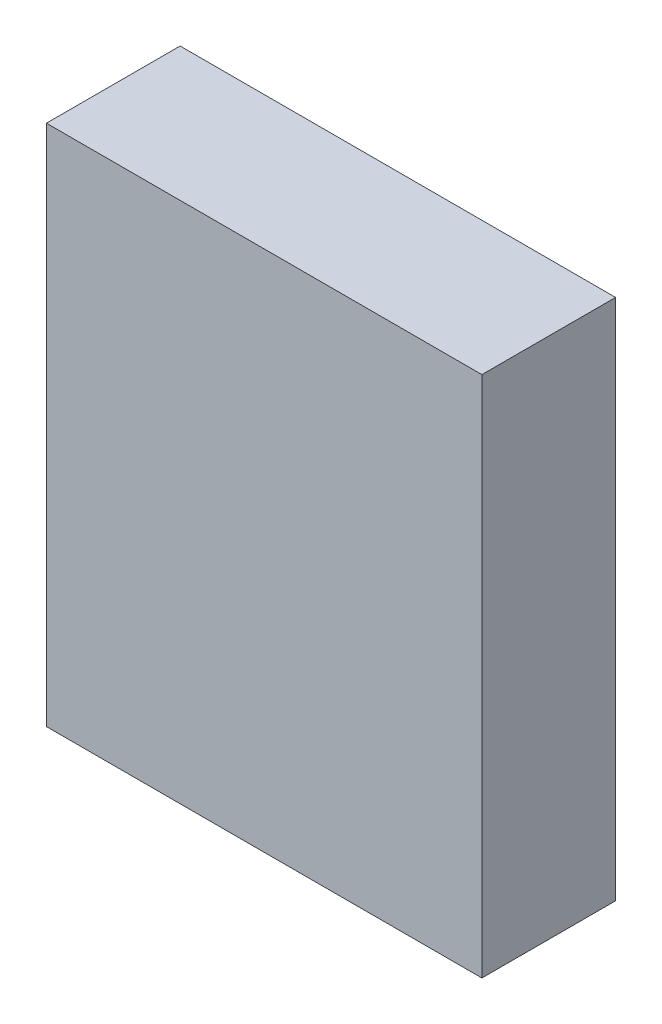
ISO-10303-21;
HEADER;
FILE_DESCRIPTION(('STEP AP214'),'2;1');
FILE_NAME('part.step','',(''),(''),'','','');
FILE_SCHEMA(('AUTOMOTIVE_DESIGN { 1 0 10303 214 1 1 1 1 }'));
ENDSEC;
DATA;
#1=APPLICATION_CONTEXT('core data for automotive mechanical design processes');
#2=APPLICATION_PROTOCOL_DEFINITION('international standard','automotive_design',2000,#1);
#3=PRODUCT_CONTEXT('',#1,'mechanical');
#4=PRODUCT('Part','Part','',(#3));
#5=PRODUCT_RELATED_PRODUCT_CATEGORY('part','',(#4));
#6=PRODUCT_DEFINITION_FORMATION('','',#4);
#7=PRODUCT_DEFINITION_CONTEXT('part definition',#1,'design');
#8=PRODUCT_DEFINITION('design','',#6,#7);
#9=PRODUCT_DEFINITION_SHAPE('','',#8);
#10=(LENGTH_UNIT() NAMED_UNIT(*) SI_UNIT(.MILLI.,.METRE.));
#11=(NAMED_UNIT(*) PLANE_ANGLE_UNIT() SI_UNIT($,.RADIAN.));
#12=(NAMED_UNIT(*) SI_UNIT($,.STERADIAN.) SOLID_ANGLE_UNIT());
#13=UNCERTAINTY_MEASURE_WITH_UNIT(LENGTH_MEASURE(1.E-05),#10,'distance_accuracy_value','');
#14=(GEOMETRIC_REPRESENTATION_CONTEXT(3) GLOBAL_UNCERTAINTY_ASSIGNED_CONTEXT((#13)) GLOBAL_UNIT_ASSIGNED_CONTEXT((#10,
#11,#12)) REPRESENTATION_CONTEXT('',''));
#15=CARTESIAN_POINT('',(0.,0.,0.));
#16=DIRECTION('',(0.,0.,1.));
#17=DIRECTION('',(1.,0.,0.));
#18=AXIS2_PLACEMENT_3D('',#15,#16,#17);
#19=CARTESIAN_POINT('',(25.4,-15.24,0.));
#20=DIRECTION('',(0.,1.,0.));
#21=DIRECTION('',(0.,0.,1.));
#22=AXIS2_PLACEMENT_3D('',#19,#20,#21);
#23=PLANE('',#22);
#24=DIRECTION('',(0.,0.,-1.));
#25=VECTOR('',#24,1.);
#26=CARTESIAN_POINT('',(0.,-15.24,0.));
#27=LINE('',#26,#25);
#28=CARTESIAN_POINT('',(0.,-15.24,0.));
#29=VERTEX_POINT('',#28);
#30=CARTESIAN_POINT('',(0.,-15.24,-7.79779999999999));
#31=VERTEX_POINT('',#30);
#32=EDGE_CURVE('E115',#29,#31,#27,.T.);
#33=ORIENTED_EDGE('',*,*,#32,.T.);
#34=DIRECTION('',(-1.,0.,0.));
#35=VECTOR('',#34,1.);
#36=CARTESIAN_POINT('',(25.4,-15.24,-7.79779999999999));
#37=LINE('',#36,#35);
#38=CARTESIAN_POINT('',(25.4,-15.24,-7.79779999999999));
#39=VERTEX_POINT('',#38);
#40=EDGE_CURVE('E11',#39,#31,#37,.T.);
#41=ORIENTED_EDGE('',*,*,#40,.F.);
#42=DIRECTION('',(0.,0.,-1.));
#43=VECTOR('',#42,1.);
#44=CARTESIAN_POINT('',(25.4,-15.24,0.));
#45=LINE('',#44,#43);
#46=CARTESIAN_POINT('',(25.4,-15.24,0.));
#47=VERTEX_POINT('',#46);
#48=EDGE_CURVE('E92',#47,#39,#45,.T.);
#49=ORIENTED_EDGE('',*,*,#48,.F.);
#50=DIRECTION('',(-1.,0.,0.));
#51=VECTOR('',#50,1.);
#52=CARTESIAN_POINT('',(25.4,-15.24,0.));
#53=LINE('',#52,#51);
#54=EDGE_CURVE('E107',#47,#29,#53,.T.);
#55=ORIENTED_EDGE('',*,*,#54,.T.);
#56=EDGE_LOOP('',(#33,#41,#49,#55));
#57=FACE_BOUND('',#56,.T.);
#58=ADVANCED_FACE('F43',(#57),#23,.F.);
#59=CARTESIAN_POINT('',(25.4,-15.24,-7.79779999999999));
#60=DIRECTION('',(0.,0.,1.));
#61=DIRECTION('',(1.,0.,0.));
#62=AXIS2_PLACEMENT_3D('',#59,#60,#61);
#63=PLANE('',#62);
#64=DIRECTION('',(0.,1.,0.));
#65=VECTOR('',#64,1.);
#66=CARTESIAN_POINT('',(0.,-15.24,-7.79779999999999));
#67=LINE('',#66,#65);
#68=CARTESIAN_POINT('',(0.,15.24,-7.79779999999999));
#69=VERTEX_POINT('',#68);
#70=EDGE_CURVE('E99',#31,#69,#67,.T.);
#71=ORIENTED_EDGE('',*,*,#70,.T.);
#72=DIRECTION('',(-1.,0.,0.));
#73=VECTOR('',#72,1.);
#74=CARTESIAN_POINT('',(25.4,15.24,-7.79779999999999));
#75=LINE('',#74,#73);
#76=CARTESIAN_POINT('',(25.4,15.24,-7.79779999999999));
#77=VERTEX_POINT('',#76);
#78=EDGE_CURVE('E55',#77,#69,#75,.T.);
#79=ORIENTED_EDGE('',*,*,#78,.F.);
#80=DIRECTION('',(0.,1.,0.));
#81=VECTOR('',#80,1.);
#82=CARTESIAN_POINT('',(25.4,-15.24,-7.79779999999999));
#83=LINE('',#82,#81);
#84=EDGE_CURVE('E89',#39,#77,#83,.T.);
#85=ORIENTED_EDGE('',*,*,#84,.F.);
#86=ORIENTED_EDGE('',*,*,#40,.T.);
#87=EDGE_LOOP('',(#71,#79,#85,#86));
#88=FACE_BOUND('',#87,.T.);
#89=ADVANCED_FACE('F97',(#88),#63,.F.);
#90=CARTESIAN_POINT('',(25.4,15.24,-7.79779999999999));
#91=DIRECTION('',(0.,-1.,0.));
#92=DIRECTION('',(0.,0.,-1.));
#93=AXIS2_PLACEMENT_3D('',#90,#91,#92);
#94=PLANE('',#93);
#95=DIRECTION('',(0.,0.,1.));
#96=VECTOR('',#95,1.);
#97=CARTESIAN_POINT('',(0.,15.24,-7.79779999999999));
#98=LINE('',#97,#96);
#99=CARTESIAN_POINT('',(0.,15.24,0.));
#100=VERTEX_POINT('',#99);
#101=EDGE_CURVE('E80',#69,#100,#98,.T.);
#102=ORIENTED_EDGE('',*,*,#101,.T.);
#103=DIRECTION('',(-1.,0.,0.));
#104=VECTOR('',#103,1.);
#105=CARTESIAN_POINT('',(25.4,15.24,0.));
#106=LINE('',#105,#104);
#107=CARTESIAN_POINT('',(25.4,15.24,0.));
#108=VERTEX_POINT('',#107);
#109=EDGE_CURVE('E105',#108,#100,#106,.T.);
#110=ORIENTED_EDGE('',*,*,#109,.F.);
#111=DIRECTION('',(0.,0.,1.));
#112=VECTOR('',#111,1.);
#113=CARTESIAN_POINT('',(25.4,15.24,-7.79779999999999));
#114=LINE('',#113,#112);
#115=EDGE_CURVE('E91',#77,#108,#114,.T.);
#116=ORIENTED_EDGE('',*,*,#115,.F.);
#117=ORIENTED_EDGE('',*,*,#78,.T.);
#118=EDGE_LOOP('',(#102,#110,#116,#117));
#119=FACE_BOUND('',#118,.T.);
#120=ADVANCED_FACE('F103',(#119),#94,.F.);
#121=CARTESIAN_POINT('',(25.4,15.24,0.));
#122=DIRECTION('',(0.,0.,-1.));
#123=DIRECTION('',(-1.,0.,0.));
#124=AXIS2_PLACEMENT_3D('',#121,#122,#123);
#125=PLANE('',#124);
#126=DIRECTION('',(0.,-1.,0.));
#127=VECTOR('',#126,1.);
#128=CARTESIAN_POINT('',(0.,15.24,0.));
#129=LINE('',#128,#127);
#130=EDGE_CURVE('E83',#100,#29,#129,.T.);
#131=ORIENTED_EDGE('',*,*,#130,.T.);
#132=ORIENTED_EDGE('',*,*,#54,.F.);
#133=DIRECTION('',(0.,-1.,0.));
#134=VECTOR('',#133,1.);
#135=CARTESIAN_POINT('',(25.4,15.24,0.));
#136=LINE('',#135,#134);
#137=EDGE_CURVE('E58',#108,#47,#136,.T.);
#138=ORIENTED_EDGE('',*,*,#137,.F.);
#139=ORIENTED_EDGE('',*,*,#109,.T.);
#140=EDGE_LOOP('',(#131,#132,#138,#139));
#141=FACE_BOUND('',#140,.T.);
#142=ADVANCED_FACE('F127',(#141),#125,.F.);
#143=CARTESIAN_POINT('',(25.4,0.,0.));
#144=DIRECTION('',(1.,0.,0.));
#145=DIRECTION('',(0.,0.,-1.));
#146=AXIS2_PLACEMENT_3D('',#143,#144,#145);
#147=PLANE('',#146);
#148=ORIENTED_EDGE('',*,*,#48,.T.);
#149=ORIENTED_EDGE('',*,*,#84,.T.);
#150=ORIENTED_EDGE('',*,*,#115,.T.);
#151=ORIENTED_EDGE('',*,*,#137,.T.);
#152=EDGE_LOOP('',(#148,#149,#150,#151));
#153=FACE_BOUND('',#152,.T.);
#154=ADVANCED_FACE('F93',(#153),#147,.T.);
#155=CARTESIAN_POINT('',(0.,0.,0.));
#156=DIRECTION('',(1.,0.,0.));
#157=DIRECTION('',(0.,0.,-1.));
#158=AXIS2_PLACEMENT_3D('',#155,#156,#157);
#159=PLANE('',#158);
#160=ORIENTED_EDGE('',*,*,#32,.F.);
#161=ORIENTED_EDGE('',*,*,#130,.F.);
#162=ORIENTED_EDGE('',*,*,#101,.F.);
#163=ORIENTED_EDGE('',*,*,#70,.F.);
#164=EDGE_LOOP('',(#160,#161,#162,#163));
#165=FACE_BOUND('',#164,.T.);
#166=ADVANCED_FACE('F129',(#165),#159,.F.);
#167=CLOSED_SHELL('',(#58,#89,#120,#142,#154,#166));
#168=MANIFOLD_SOLID_BREP('B2',#167);
#169=ADVANCED_BREP_SHAPE_REPRESENTATION('',(#18,#168),#14);
#170=SHAPE_DEFINITION_REPRESENTATION(#9,#169);
ENDSEC;
END-ISO-10303-21;
